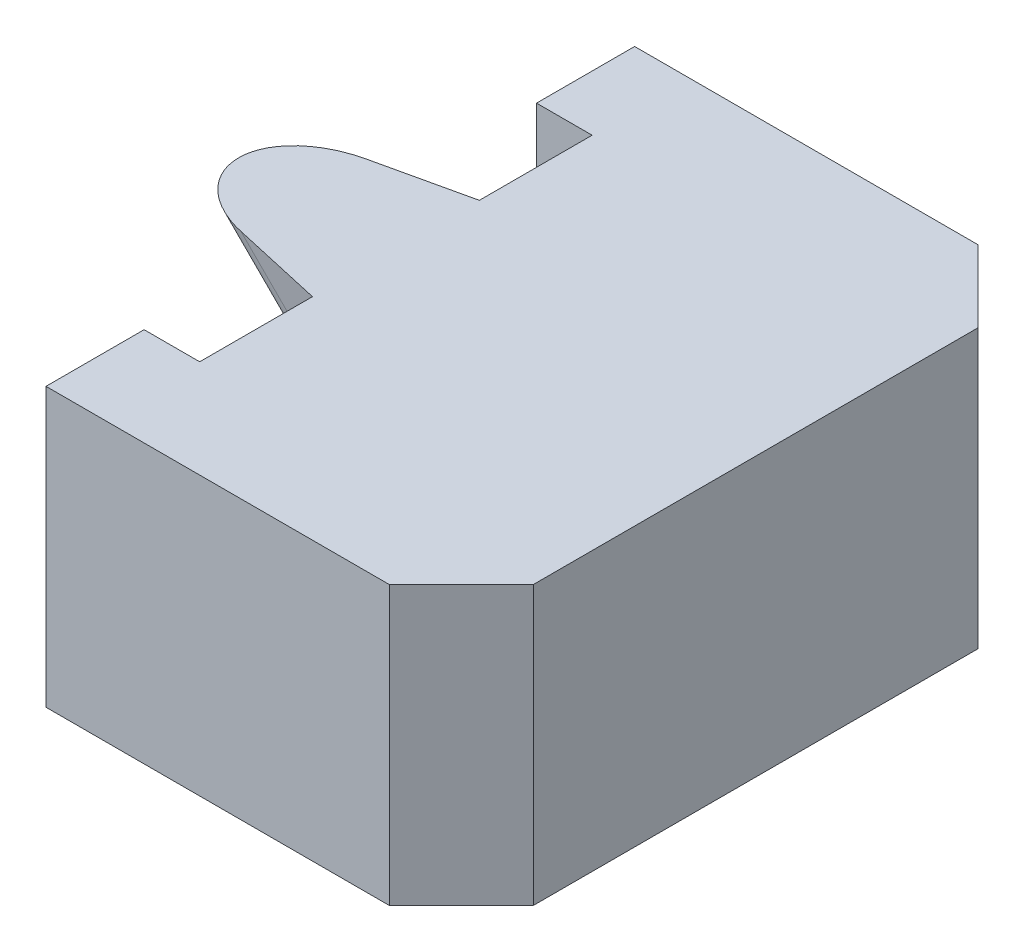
ISO-10303-21;
HEADER;
FILE_DESCRIPTION(('STEP AP214'),'2;1');
FILE_NAME('part.step','',(''),(''),'','','');
FILE_SCHEMA(('AUTOMOTIVE_DESIGN { 1 0 10303 214 1 1 1 1 }'));
ENDSEC;
DATA;
#1=APPLICATION_CONTEXT('core data for automotive mechanical design processes');
#2=APPLICATION_PROTOCOL_DEFINITION('international standard','automotive_design',2000,#1);
#3=PRODUCT_CONTEXT('',#1,'mechanical');
#4=PRODUCT('Part','Part','',(#3));
#5=PRODUCT_RELATED_PRODUCT_CATEGORY('part','',(#4));
#6=PRODUCT_DEFINITION_FORMATION('','',#4);
#7=PRODUCT_DEFINITION_CONTEXT('part definition',#1,'design');
#8=PRODUCT_DEFINITION('design','',#6,#7);
#9=PRODUCT_DEFINITION_SHAPE('','',#8);
#10=(LENGTH_UNIT() NAMED_UNIT(*) SI_UNIT(.MILLI.,.METRE.));
#11=(NAMED_UNIT(*) PLANE_ANGLE_UNIT() SI_UNIT($,.RADIAN.));
#12=(NAMED_UNIT(*) SI_UNIT($,.STERADIAN.) SOLID_ANGLE_UNIT());
#13=UNCERTAINTY_MEASURE_WITH_UNIT(LENGTH_MEASURE(1.E-05),#10,'distance_accuracy_value','');
#14=(GEOMETRIC_REPRESENTATION_CONTEXT(3) GLOBAL_UNCERTAINTY_ASSIGNED_CONTEXT((#13)) GLOBAL_UNIT_ASSIGNED_CONTEXT((#10,
#11,#12)) REPRESENTATION_CONTEXT('',''));
#15=CARTESIAN_POINT('',(0.,0.,0.));
#16=DIRECTION('',(0.,0.,1.));
#17=DIRECTION('',(1.,0.,0.));
#18=AXIS2_PLACEMENT_3D('',#15,#16,#17);
#19=CARTESIAN_POINT('',(-21.6603765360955,-8.5,10.766004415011));
#20=DIRECTION('',(1.,0.,0.));
#21=DIRECTION('',(0.,0.,-1.));
#22=AXIS2_PLACEMENT_3D('',#19,#20,#21);
#23=PLANE('',#22);
#24=DIRECTION('',(0.,0.975620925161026,0.219462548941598));
#25=VECTOR('',#24,1.);
#26=CARTESIAN_POINT('',(-21.6603765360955,-7.49665949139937,6.30565343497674));
#27=LINE('',#26,#25);
#28=CARTESIAN_POINT('',(-21.6603765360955,-5.82619744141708,6.68141808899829));
#29=VERTEX_POINT('',#28);
#30=CARTESIAN_POINT('',(-21.6603765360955,-3.,7.31716141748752));
#31=VERTEX_POINT('',#30);
#32=EDGE_CURVE('E44',#29,#31,#27,.T.);
#33=ORIENTED_EDGE('',*,*,#32,.F.);
#34=CARTESIAN_POINT('',(-21.6603765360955,-4.96446609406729,4.76600441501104));
#35=DIRECTION('',(1.,0.,0.));
#36=DIRECTION('',(0.,-1.,0.));
#37=AXIS2_PLACEMENT_3D('',#34,#35,#36);
#38=ELLIPSE('',#37,2.8425692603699,2.01);
#39=CARTESIAN_POINT('',(-21.6603765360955,-5.82619744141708,2.85059074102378));
#40=VERTEX_POINT('',#39);
#41=EDGE_CURVE('E11',#40,#29,#38,.F.);
#42=ORIENTED_EDGE('',*,*,#41,.F.);
#43=DIRECTION('',(0.,-0.975620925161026,0.219462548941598));
#44=VECTOR('',#43,1.);
#45=CARTESIAN_POINT('',(-21.6603765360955,-10.0660065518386,3.80432111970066));
#46=LINE('',#45,#44);
#47=CARTESIAN_POINT('',(-21.6603765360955,-3.,2.21484741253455));
#48=VERTEX_POINT('',#47);
#49=EDGE_CURVE('E144',#48,#40,#46,.T.);
#50=ORIENTED_EDGE('',*,*,#49,.F.);
#51=DIRECTION('',(0.,0.,-1.));
#52=VECTOR('',#51,1.);
#53=CARTESIAN_POINT('',(-21.6603765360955,-3.,-1.23399558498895));
#54=LINE('',#53,#52);
#55=CARTESIAN_POINT('',(-21.6603765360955,-3.,-1.23399558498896));
#56=VERTEX_POINT('',#55);
#57=EDGE_CURVE('E240',#48,#56,#54,.T.);
#58=ORIENTED_EDGE('',*,*,#57,.T.);
#59=DIRECTION('',(0.,1.,0.));
#60=VECTOR('',#59,1.);
#61=CARTESIAN_POINT('',(-21.6603765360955,-8.5,-1.23399558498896));
#62=LINE('',#61,#60);
#63=CARTESIAN_POINT('',(-21.6603765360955,-8.5,-1.23399558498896));
#64=VERTEX_POINT('',#63);
#65=EDGE_CURVE('E231',#64,#56,#62,.T.);
#66=ORIENTED_EDGE('',*,*,#65,.F.);
#67=DIRECTION('',(0.,0.,-1.));
#68=VECTOR('',#67,1.);
#69=CARTESIAN_POINT('',(-21.6603765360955,-8.5,10.766004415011));
#70=LINE('',#69,#68);
#71=CARTESIAN_POINT('',(-21.6603765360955,-8.5,10.766004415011));
#72=VERTEX_POINT('',#71);
#73=EDGE_CURVE('E194',#72,#64,#70,.T.);
#74=ORIENTED_EDGE('',*,*,#73,.F.);
#75=DIRECTION('',(0.,1.,0.));
#76=VECTOR('',#75,1.);
#77=CARTESIAN_POINT('',(-21.6603765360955,-8.5,10.766004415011));
#78=LINE('',#77,#76);
#79=CARTESIAN_POINT('',(-21.6603765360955,-3.,10.766004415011));
#80=VERTEX_POINT('',#79);
#81=EDGE_CURVE('E234',#72,#80,#78,.T.);
#82=ORIENTED_EDGE('',*,*,#81,.T.);
#83=EDGE_CURVE('E241',#80,#31,#54,.T.);
#84=ORIENTED_EDGE('',*,*,#83,.T.);
#85=EDGE_LOOP('',(#33,#42,#50,#58,#66,#74,#82,#84));
#86=FACE_BOUND('',#85,.T.);
#87=ADVANCED_FACE('F29',(#86),#23,.F.);
#88=CARTESIAN_POINT('',(-24.6603765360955,-3.,10.766004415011));
#89=DIRECTION('',(0.,0.,1.));
#90=DIRECTION('',(1.,0.,0.));
#91=AXIS2_PLACEMENT_3D('',#88,#89,#90);
#92=CYLINDRICAL_SURFACE('',#91,3.);
#93=CARTESIAN_POINT('',(-24.6603765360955,-3.,6.64232180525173));
#94=DIRECTION('',(0.214361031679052,0.214361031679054,-0.952942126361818));
#95=DIRECTION('',(0.673831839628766,0.673831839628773,0.303152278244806));
#96=AXIS2_PLACEMENT_3D('',#93,#94,#95);
#97=ELLIPSE('',#96,3.14814501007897,3.);
#98=CARTESIAN_POINT('',(-24.6603765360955,0.,7.31716141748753));
#99=VERTEX_POINT('',#98);
#100=EDGE_CURVE('E37',#31,#99,#97,.F.);
#101=ORIENTED_EDGE('',*,*,#100,.F.);
#102=ORIENTED_EDGE('',*,*,#83,.F.);
#103=CARTESIAN_POINT('',(-24.6603765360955,-3.,10.766004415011));
#104=DIRECTION('',(0.,0.,1.));
#105=DIRECTION('',(1.,0.,0.));
#106=AXIS2_PLACEMENT_3D('',#103,#104,#105);
#107=CIRCLE('',#106,3.);
#108=CARTESIAN_POINT('',(-24.6603765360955,0.,10.766004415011));
#109=VERTEX_POINT('',#108);
#110=EDGE_CURVE('E248',#109,#80,#107,.F.);
#111=ORIENTED_EDGE('',*,*,#110,.F.);
#112=DIRECTION('',(0.,0.,-1.));
#113=VECTOR('',#112,1.);
#114=CARTESIAN_POINT('',(-24.6603765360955,0.,10.766004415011));
#115=LINE('',#114,#113);
#116=EDGE_CURVE('E246',#99,#109,#115,.F.);
#117=ORIENTED_EDGE('',*,*,#116,.F.);
#118=EDGE_LOOP('',(#101,#102,#111,#117));
#119=FACE_BOUND('',#118,.T.);
#120=ADVANCED_FACE('F257',(#119),#92,.F.);
#121=CARTESIAN_POINT('',(-24.6603765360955,-3.,2.88968702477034));
#122=DIRECTION('',(0.214361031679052,0.214361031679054,0.952942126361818));
#123=DIRECTION('',(-0.673831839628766,-0.673831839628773,0.303152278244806));
#124=AXIS2_PLACEMENT_3D('',#121,#122,#123);
#125=ELLIPSE('',#124,3.14814501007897,3.);
#126=CARTESIAN_POINT('',(-24.6603765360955,0.,2.21484741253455));
#127=VERTEX_POINT('',#126);
#128=EDGE_CURVE('E250',#127,#48,#125,.F.);
#129=ORIENTED_EDGE('',*,*,#128,.F.);
#130=CARTESIAN_POINT('',(-24.6603765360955,0.,-1.23399558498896));
#131=VERTEX_POINT('',#130);
#132=EDGE_CURVE('E139',#131,#127,#115,.F.);
#133=ORIENTED_EDGE('',*,*,#132,.F.);
#134=CARTESIAN_POINT('',(-24.6603765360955,-3.,-1.23399558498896));
#135=DIRECTION('',(0.,0.,-1.));
#136=DIRECTION('',(-1.,0.,0.));
#137=AXIS2_PLACEMENT_3D('',#134,#135,#136);
#138=CIRCLE('',#137,3.);
#139=EDGE_CURVE('E243',#56,#131,#138,.F.);
#140=ORIENTED_EDGE('',*,*,#139,.F.);
#141=ORIENTED_EDGE('',*,*,#57,.F.);
#142=EDGE_LOOP('',(#129,#133,#140,#141));
#143=FACE_BOUND('',#142,.T.);
#144=ADVANCED_FACE('F299',(#143),#92,.F.);
#145=CARTESIAN_POINT('',(-26.3603765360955,-8.5,13.766004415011));
#146=DIRECTION('',(1.,0.,0.));
#147=DIRECTION('',(0.,0.,-1.));
#148=AXIS2_PLACEMENT_3D('',#145,#146,#147);
#149=PLANE('',#148);
#150=DIRECTION('',(0.,0.,-1.));
#151=VECTOR('',#150,1.);
#152=CARTESIAN_POINT('',(-26.3603765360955,0.,13.766004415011));
#153=LINE('',#152,#151);
#154=CARTESIAN_POINT('',(-26.3603765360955,0.,13.766004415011));
#155=VERTEX_POINT('',#154);
#156=CARTESIAN_POINT('',(-26.3603765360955,0.,10.766004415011));
#157=VERTEX_POINT('',#156);
#158=EDGE_CURVE('E153',#155,#157,#153,.T.);
#159=ORIENTED_EDGE('',*,*,#158,.T.);
#160=DIRECTION('',(0.,1.,0.));
#161=VECTOR('',#160,1.);
#162=CARTESIAN_POINT('',(-26.3603765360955,-8.5,10.766004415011));
#163=LINE('',#162,#161);
#164=CARTESIAN_POINT('',(-26.3603765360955,-8.5,10.766004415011));
#165=VERTEX_POINT('',#164);
#166=EDGE_CURVE('E237',#165,#157,#163,.T.);
#167=ORIENTED_EDGE('',*,*,#166,.F.);
#168=DIRECTION('',(0.,0.,-1.));
#169=VECTOR('',#168,1.);
#170=CARTESIAN_POINT('',(-26.3603765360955,-8.5,13.766004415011));
#171=LINE('',#170,#169);
#172=CARTESIAN_POINT('',(-26.3603765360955,-8.5,13.766004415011));
#173=VERTEX_POINT('',#172);
#174=EDGE_CURVE('E189',#173,#165,#171,.T.);
#175=ORIENTED_EDGE('',*,*,#174,.F.);
#176=DIRECTION('',(0.,1.,0.));
#177=VECTOR('',#176,1.);
#178=CARTESIAN_POINT('',(-26.3603765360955,-8.5,13.766004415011));
#179=LINE('',#178,#177);
#180=EDGE_CURVE('E210',#173,#155,#179,.T.);
#181=ORIENTED_EDGE('',*,*,#180,.T.);
#182=EDGE_LOOP('',(#159,#167,#175,#181));
#183=FACE_BOUND('',#182,.T.);
#184=ADVANCED_FACE('F31',(#183),#149,.F.);
#185=CARTESIAN_POINT('',(-26.3603765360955,-8.5,10.766004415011));
#186=DIRECTION('',(0.,0.,1.));
#187=DIRECTION('',(1.,0.,0.));
#188=AXIS2_PLACEMENT_3D('',#185,#186,#187);
#189=PLANE('',#188);
#190=DIRECTION('',(1.,0.,0.));
#191=VECTOR('',#190,1.);
#192=CARTESIAN_POINT('',(-26.3603765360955,0.,10.766004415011));
#193=LINE('',#192,#191);
#194=EDGE_CURVE('E165',#157,#109,#193,.T.);
#195=ORIENTED_EDGE('',*,*,#194,.T.);
#196=ORIENTED_EDGE('',*,*,#110,.T.);
#197=ORIENTED_EDGE('',*,*,#81,.F.);
#198=DIRECTION('',(1.,0.,0.));
#199=VECTOR('',#198,1.);
#200=CARTESIAN_POINT('',(-26.3603765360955,-8.5,10.766004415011));
#201=LINE('',#200,#199);
#202=EDGE_CURVE('E192',#165,#72,#201,.T.);
#203=ORIENTED_EDGE('',*,*,#202,.F.);
#204=ORIENTED_EDGE('',*,*,#166,.T.);
#205=EDGE_LOOP('',(#195,#196,#197,#203,#204));
#206=FACE_BOUND('',#205,.T.);
#207=ADVANCED_FACE('F263',(#206),#189,.F.);
#208=CARTESIAN_POINT('',(-21.6603765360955,-8.5,-1.23399558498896));
#209=DIRECTION('',(0.,0.,-1.));
#210=DIRECTION('',(-1.,0.,0.));
#211=AXIS2_PLACEMENT_3D('',#208,#209,#210);
#212=PLANE('',#211);
#213=ORIENTED_EDGE('',*,*,#65,.T.);
#214=ORIENTED_EDGE('',*,*,#139,.T.);
#215=DIRECTION('',(-1.,0.,0.));
#216=VECTOR('',#215,1.);
#217=CARTESIAN_POINT('',(-21.6603765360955,0.,-1.23399558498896));
#218=LINE('',#217,#216);
#219=CARTESIAN_POINT('',(-26.3603765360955,0.,-1.23399558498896));
#220=VERTEX_POINT('',#219);
#221=EDGE_CURVE('E168',#131,#220,#218,.T.);
#222=ORIENTED_EDGE('',*,*,#221,.T.);
#223=DIRECTION('',(0.,1.,0.));
#224=VECTOR('',#223,1.);
#225=CARTESIAN_POINT('',(-26.3603765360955,-8.5,-1.23399558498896));
#226=LINE('',#225,#224);
#227=CARTESIAN_POINT('',(-26.3603765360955,-8.5,-1.23399558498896));
#228=VERTEX_POINT('',#227);
#229=EDGE_CURVE('E228',#228,#220,#226,.T.);
#230=ORIENTED_EDGE('',*,*,#229,.F.);
#231=DIRECTION('',(-1.,0.,0.));
#232=VECTOR('',#231,1.);
#233=CARTESIAN_POINT('',(-21.6603765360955,-8.5,-1.23399558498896));
#234=LINE('',#233,#232);
#235=EDGE_CURVE('E196',#64,#228,#234,.T.);
#236=ORIENTED_EDGE('',*,*,#235,.F.);
#237=EDGE_LOOP('',(#213,#214,#222,#230,#236));
#238=FACE_BOUND('',#237,.T.);
#239=ADVANCED_FACE('F295',(#238),#212,.F.);
#240=CARTESIAN_POINT('',(-26.3603765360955,-8.5,-4.23399558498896));
#241=DIRECTION('',(1.,0.,0.));
#242=DIRECTION('',(0.,0.,-1.));
#243=AXIS2_PLACEMENT_3D('',#240,#241,#242);
#244=PLANE('',#243);
#245=DIRECTION('',(0.,0.,-1.));
#246=VECTOR('',#245,1.);
#247=CARTESIAN_POINT('',(-26.3603765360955,0.,-4.23399558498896));
#248=LINE('',#247,#246);
#249=CARTESIAN_POINT('',(-26.3603765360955,0.,-4.23399558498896));
#250=VERTEX_POINT('',#249);
#251=EDGE_CURVE('E171',#220,#250,#248,.T.);
#252=ORIENTED_EDGE('',*,*,#251,.T.);
#253=DIRECTION('',(0.,1.,0.));
#254=VECTOR('',#253,1.);
#255=CARTESIAN_POINT('',(-26.3603765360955,-8.5,-4.23399558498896));
#256=LINE('',#255,#254);
#257=CARTESIAN_POINT('',(-26.3603765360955,-8.5,-4.23399558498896));
#258=VERTEX_POINT('',#257);
#259=EDGE_CURVE('E225',#258,#250,#256,.T.);
#260=ORIENTED_EDGE('',*,*,#259,.F.);
#261=DIRECTION('',(0.,0.,-1.));
#262=VECTOR('',#261,1.);
#263=CARTESIAN_POINT('',(-26.3603765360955,-8.5,-4.23399558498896));
#264=LINE('',#263,#262);
#265=EDGE_CURVE('E198',#228,#258,#264,.T.);
#266=ORIENTED_EDGE('',*,*,#265,.F.);
#267=ORIENTED_EDGE('',*,*,#229,.T.);
#268=EDGE_LOOP('',(#252,#260,#266,#267));
#269=FACE_BOUND('',#268,.T.);
#270=ADVANCED_FACE('F292',(#269),#244,.F.);
#271=CARTESIAN_POINT('',(-26.3603765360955,-8.5,-4.23399558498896));
#272=DIRECTION('',(0.,0.,1.));
#273=DIRECTION('',(1.,0.,0.));
#274=AXIS2_PLACEMENT_3D('',#271,#272,#273);
#275=PLANE('',#274);
#276=DIRECTION('',(1.,0.,0.));
#277=VECTOR('',#276,1.);
#278=CARTESIAN_POINT('',(-26.3603765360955,0.,-4.23399558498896));
#279=LINE('',#278,#277);
#280=CARTESIAN_POINT('',(-15.8603765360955,0.,-4.23399558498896));
#281=VERTEX_POINT('',#280);
#282=EDGE_CURVE('E174',#250,#281,#279,.T.);
#283=ORIENTED_EDGE('',*,*,#282,.T.);
#284=DIRECTION('',(0.,1.,0.));
#285=VECTOR('',#284,1.);
#286=CARTESIAN_POINT('',(-15.8603765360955,-8.5,-4.23399558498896));
#287=LINE('',#286,#285);
#288=CARTESIAN_POINT('',(-15.8603765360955,-8.5,-4.23399558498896));
#289=VERTEX_POINT('',#288);
#290=EDGE_CURVE('E222',#289,#281,#287,.T.);
#291=ORIENTED_EDGE('',*,*,#290,.F.);
#292=DIRECTION('',(1.,0.,0.));
#293=VECTOR('',#292,1.);
#294=CARTESIAN_POINT('',(-26.3603765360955,-8.5,-4.23399558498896));
#295=LINE('',#294,#293);
#296=EDGE_CURVE('E200',#258,#289,#295,.T.);
#297=ORIENTED_EDGE('',*,*,#296,.F.);
#298=ORIENTED_EDGE('',*,*,#259,.T.);
#299=EDGE_LOOP('',(#283,#291,#297,#298));
#300=FACE_BOUND('',#299,.T.);
#301=ADVANCED_FACE('F287',(#300),#275,.F.);
#302=CARTESIAN_POINT('',(-13.6603765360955,-8.5,-2.03399558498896));
#303=DIRECTION('',(-0.707106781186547,0.,0.707106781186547));
#304=DIRECTION('',(0.707106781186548,0.,0.707106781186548));
#305=AXIS2_PLACEMENT_3D('',#302,#303,#304);
#306=PLANE('',#305);
#307=DIRECTION('',(0.707106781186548,0.,0.707106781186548));
#308=VECTOR('',#307,1.);
#309=CARTESIAN_POINT('',(-13.6603765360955,0.,-2.03399558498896));
#310=LINE('',#309,#308);
#311=CARTESIAN_POINT('',(-13.6603765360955,0.,-2.03399558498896));
#312=VERTEX_POINT('',#311);
#313=EDGE_CURVE('E177',#281,#312,#310,.T.);
#314=ORIENTED_EDGE('',*,*,#313,.T.);
#315=DIRECTION('',(0.,1.,0.));
#316=VECTOR('',#315,1.);
#317=CARTESIAN_POINT('',(-13.6603765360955,-8.5,-2.03399558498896));
#318=LINE('',#317,#316);
#319=CARTESIAN_POINT('',(-13.6603765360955,-8.5,-2.03399558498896));
#320=VERTEX_POINT('',#319);
#321=EDGE_CURVE('E219',#320,#312,#318,.T.);
#322=ORIENTED_EDGE('',*,*,#321,.F.);
#323=DIRECTION('',(0.707106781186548,0.,0.707106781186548));
#324=VECTOR('',#323,1.);
#325=CARTESIAN_POINT('',(-13.6603765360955,-8.5,-2.03399558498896));
#326=LINE('',#325,#324);
#327=EDGE_CURVE('E202',#289,#320,#326,.T.);
#328=ORIENTED_EDGE('',*,*,#327,.F.);
#329=ORIENTED_EDGE('',*,*,#290,.T.);
#330=EDGE_LOOP('',(#314,#322,#328,#329));
#331=FACE_BOUND('',#330,.T.);
#332=ADVANCED_FACE('F284',(#331),#306,.F.);
#333=CARTESIAN_POINT('',(-13.6603765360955,-8.5,11.566004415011));
#334=DIRECTION('',(-1.,0.,0.));
#335=DIRECTION('',(0.,0.,1.));
#336=AXIS2_PLACEMENT_3D('',#333,#334,#335);
#337=PLANE('',#336);
#338=DIRECTION('',(0.,0.,1.));
#339=VECTOR('',#338,1.);
#340=CARTESIAN_POINT('',(-13.6603765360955,0.,11.566004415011));
#341=LINE('',#340,#339);
#342=CARTESIAN_POINT('',(-13.6603765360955,0.,11.566004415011));
#343=VERTEX_POINT('',#342);
#344=EDGE_CURVE('E180',#312,#343,#341,.T.);
#345=ORIENTED_EDGE('',*,*,#344,.T.);
#346=DIRECTION('',(0.,1.,0.));
#347=VECTOR('',#346,1.);
#348=CARTESIAN_POINT('',(-13.6603765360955,-8.5,11.566004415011));
#349=LINE('',#348,#347);
#350=CARTESIAN_POINT('',(-13.6603765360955,-8.5,11.566004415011));
#351=VERTEX_POINT('',#350);
#352=EDGE_CURVE('E216',#351,#343,#349,.T.);
#353=ORIENTED_EDGE('',*,*,#352,.F.);
#354=DIRECTION('',(0.,0.,1.));
#355=VECTOR('',#354,1.);
#356=CARTESIAN_POINT('',(-13.6603765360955,-8.5,11.566004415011));
#357=LINE('',#356,#355);
#358=EDGE_CURVE('E204',#320,#351,#357,.T.);
#359=ORIENTED_EDGE('',*,*,#358,.F.);
#360=ORIENTED_EDGE('',*,*,#321,.T.);
#361=EDGE_LOOP('',(#345,#353,#359,#360));
#362=FACE_BOUND('',#361,.T.);
#363=ADVANCED_FACE('F280',(#362),#337,.F.);
#364=CARTESIAN_POINT('',(-15.8603765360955,-8.5,13.766004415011));
#365=DIRECTION('',(-0.707106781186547,0.,-0.707106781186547));
#366=DIRECTION('',(-0.707106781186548,0.,0.707106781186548));
#367=AXIS2_PLACEMENT_3D('',#364,#365,#366);
#368=PLANE('',#367);
#369=DIRECTION('',(-0.707106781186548,0.,0.707106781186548));
#370=VECTOR('',#369,1.);
#371=CARTESIAN_POINT('',(-15.8603765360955,0.,13.766004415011));
#372=LINE('',#371,#370);
#373=CARTESIAN_POINT('',(-15.8603765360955,0.,13.766004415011));
#374=VERTEX_POINT('',#373);
#375=EDGE_CURVE('E183',#343,#374,#372,.T.);
#376=ORIENTED_EDGE('',*,*,#375,.T.);
#377=DIRECTION('',(0.,1.,0.));
#378=VECTOR('',#377,1.);
#379=CARTESIAN_POINT('',(-15.8603765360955,-8.5,13.766004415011));
#380=LINE('',#379,#378);
#381=CARTESIAN_POINT('',(-15.8603765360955,-8.5,13.766004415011));
#382=VERTEX_POINT('',#381);
#383=EDGE_CURVE('E213',#382,#374,#380,.T.);
#384=ORIENTED_EDGE('',*,*,#383,.F.);
#385=DIRECTION('',(-0.707106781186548,0.,0.707106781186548));
#386=VECTOR('',#385,1.);
#387=CARTESIAN_POINT('',(-15.8603765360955,-8.5,13.766004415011));
#388=LINE('',#387,#386);
#389=EDGE_CURVE('E206',#351,#382,#388,.T.);
#390=ORIENTED_EDGE('',*,*,#389,.F.);
#391=ORIENTED_EDGE('',*,*,#352,.T.);
#392=EDGE_LOOP('',(#376,#384,#390,#391));
#393=FACE_BOUND('',#392,.T.);
#394=ADVANCED_FACE('F278',(#393),#368,.F.);
#395=CARTESIAN_POINT('',(-26.3603765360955,-8.5,13.766004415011));
#396=DIRECTION('',(0.,0.,-1.));
#397=DIRECTION('',(-1.,0.,0.));
#398=AXIS2_PLACEMENT_3D('',#395,#396,#397);
#399=PLANE('',#398);
#400=DIRECTION('',(-1.,0.,0.));
#401=VECTOR('',#400,1.);
#402=CARTESIAN_POINT('',(-26.3603765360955,0.,13.766004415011));
#403=LINE('',#402,#401);
#404=EDGE_CURVE('E186',#374,#155,#403,.T.);
#405=ORIENTED_EDGE('',*,*,#404,.T.);
#406=ORIENTED_EDGE('',*,*,#180,.F.);
#407=DIRECTION('',(-1.,0.,0.));
#408=VECTOR('',#407,1.);
#409=CARTESIAN_POINT('',(-26.3603765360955,-8.5,13.766004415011));
#410=LINE('',#409,#408);
#411=EDGE_CURVE('E208',#382,#173,#410,.T.);
#412=ORIENTED_EDGE('',*,*,#411,.F.);
#413=ORIENTED_EDGE('',*,*,#383,.T.);
#414=EDGE_LOOP('',(#405,#406,#412,#413));
#415=FACE_BOUND('',#414,.T.);
#416=ADVANCED_FACE('F268',(#415),#399,.F.);
#417=CARTESIAN_POINT('',(-26.3603765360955,-8.5,10.766004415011));
#418=DIRECTION('',(0.,-1.,0.));
#419=DIRECTION('',(0.,0.,-1.));
#420=AXIS2_PLACEMENT_3D('',#417,#418,#419);
#421=PLANE('',#420);
#422=ORIENTED_EDGE('',*,*,#174,.T.);
#423=ORIENTED_EDGE('',*,*,#202,.T.);
#424=ORIENTED_EDGE('',*,*,#73,.T.);
#425=ORIENTED_EDGE('',*,*,#235,.T.);
#426=ORIENTED_EDGE('',*,*,#265,.T.);
#427=ORIENTED_EDGE('',*,*,#296,.T.);
#428=ORIENTED_EDGE('',*,*,#327,.T.);
#429=ORIENTED_EDGE('',*,*,#358,.T.);
#430=ORIENTED_EDGE('',*,*,#389,.T.);
#431=ORIENTED_EDGE('',*,*,#411,.T.);
#432=EDGE_LOOP('',(#422,#423,#424,#425,#426,#427,#428,#429,#430,#431));
#433=FACE_BOUND('',#432,.T.);
#434=ADVANCED_FACE('F273',(#433),#421,.T.);
#435=CARTESIAN_POINT('',(-34.0347452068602,7.40990257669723,4.76600441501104));
#436=DIRECTION('',(0.707106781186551,-0.707106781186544,0.));
#437=DIRECTION('',(0.707106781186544,0.707106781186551,0.));
#438=AXIS2_PLACEMENT_3D('',#435,#436,#437);
#439=CYLINDRICAL_SURFACE('',#438,2.01);
#440=DIRECTION('',(0.707106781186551,-0.707106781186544,0.));
#441=VECTOR('',#440,1.);
#442=CARTESIAN_POINT('',(-34.4656108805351,6.97903690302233,6.68141808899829));
#443=LINE('',#442,#441);
#444=CARTESIAN_POINT('',(-27.4865739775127,0.,6.68141808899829));
#445=VERTEX_POINT('',#444);
#446=EDGE_CURVE('E152',#445,#29,#443,.T.);
#447=ORIENTED_EDGE('',*,*,#446,.F.);
#448=CARTESIAN_POINT('',(-26.6248426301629,0.,4.76600441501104));
#449=DIRECTION('',(0.,1.,0.));
#450=DIRECTION('',(1.,0.,0.));
#451=AXIS2_PLACEMENT_3D('',#448,#449,#450);
#452=ELLIPSE('',#451,2.84256926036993,2.01);
#453=CARTESIAN_POINT('',(-27.4865739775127,0.,2.85059074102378));
#454=VERTEX_POINT('',#453);
#455=EDGE_CURVE('E136',#445,#454,#452,.F.);
#456=ORIENTED_EDGE('',*,*,#455,.T.);
#457=DIRECTION('',(0.707106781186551,-0.707106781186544,0.));
#458=VECTOR('',#457,1.);
#459=CARTESIAN_POINT('',(-34.4656108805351,6.97903690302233,2.85059074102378));
#460=LINE('',#459,#458);
#461=EDGE_CURVE('E150',#454,#40,#460,.T.);
#462=ORIENTED_EDGE('',*,*,#461,.T.);
#463=ORIENTED_EDGE('',*,*,#41,.T.);
#464=EDGE_LOOP('',(#447,#456,#462,#463));
#465=FACE_BOUND('',#464,.T.);
#466=ADVANCED_FACE('F149',(#465),#439,.T.);
#467=CARTESIAN_POINT('',(-34.4656108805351,6.97903690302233,6.68141808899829));
#468=DIRECTION('',(0.214361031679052,0.214361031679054,-0.952942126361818));
#469=DIRECTION('',(0.,0.975620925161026,0.219462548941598));
#470=AXIS2_PLACEMENT_3D('',#467,#468,#469);
#471=PLANE('',#470);
#472=ORIENTED_EDGE('',*,*,#100,.T.);
#473=DIRECTION('',(-0.975620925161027,0.,-0.219462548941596));
#474=VECTOR('',#473,1.);
#475=CARTESIAN_POINT('',(-38.1404821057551,0.,4.28485834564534));
#476=LINE('',#475,#474);
#477=EDGE_CURVE('E154',#99,#445,#476,.T.);
#478=ORIENTED_EDGE('',*,*,#477,.T.);
#479=ORIENTED_EDGE('',*,*,#446,.T.);
#480=ORIENTED_EDGE('',*,*,#32,.T.);
#481=EDGE_LOOP('',(#472,#478,#479,#480));
#482=FACE_BOUND('',#481,.T.);
#483=ADVANCED_FACE('F253',(#482),#471,.F.);
#484=CARTESIAN_POINT('',(-34.4656108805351,6.97903690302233,2.85059074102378));
#485=DIRECTION('',(0.214361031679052,0.214361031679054,0.952942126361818));
#486=DIRECTION('',(0.,-0.975620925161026,0.219462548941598));
#487=AXIS2_PLACEMENT_3D('',#484,#485,#486);
#488=PLANE('',#487);
#489=ORIENTED_EDGE('',*,*,#461,.F.);
#490=DIRECTION('',(0.975620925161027,0.,-0.219462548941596));
#491=VECTOR('',#490,1.);
#492=CARTESIAN_POINT('',(-50.3860015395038,0.,8.00173767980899));
#493=LINE('',#492,#491);
#494=EDGE_CURVE('E133',#454,#127,#493,.T.);
#495=ORIENTED_EDGE('',*,*,#494,.T.);
#496=ORIENTED_EDGE('',*,*,#128,.T.);
#497=ORIENTED_EDGE('',*,*,#49,.T.);
#498=EDGE_LOOP('',(#489,#495,#496,#497));
#499=FACE_BOUND('',#498,.T.);
#500=ADVANCED_FACE('F156',(#499),#488,.F.);
#501=CARTESIAN_POINT('',(41.1067880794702,0.,120.056001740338));
#502=DIRECTION('',(0.,-1.,0.));
#503=DIRECTION('',(0.,0.,-1.));
#504=AXIS2_PLACEMENT_3D('',#501,#502,#503);
#505=PLANE('',#504);
#506=ORIENTED_EDGE('',*,*,#251,.F.);
#507=ORIENTED_EDGE('',*,*,#221,.F.);
#508=ORIENTED_EDGE('',*,*,#132,.T.);
#509=ORIENTED_EDGE('',*,*,#494,.F.);
#510=ORIENTED_EDGE('',*,*,#455,.F.);
#511=ORIENTED_EDGE('',*,*,#477,.F.);
#512=ORIENTED_EDGE('',*,*,#116,.T.);
#513=ORIENTED_EDGE('',*,*,#194,.F.);
#514=ORIENTED_EDGE('',*,*,#158,.F.);
#515=ORIENTED_EDGE('',*,*,#404,.F.);
#516=ORIENTED_EDGE('',*,*,#375,.F.);
#517=ORIENTED_EDGE('',*,*,#344,.F.);
#518=ORIENTED_EDGE('',*,*,#313,.F.);
#519=ORIENTED_EDGE('',*,*,#282,.F.);
#520=EDGE_LOOP('',(#506,#507,#508,#509,#510,#511,#512,#513,#514,#515,#516,#517,#518,#519));
#521=FACE_BOUND('',#520,.T.);
#522=ADVANCED_FACE('F135',(#521),#505,.F.);
#523=CLOSED_SHELL('',(#87,#120,#144,#184,#207,#239,#270,#301,#332,#363,#394,#416,#434,#466,#483,
#500,#522));
#524=MANIFOLD_SOLID_BREP('B2',#523);
#525=ADVANCED_BREP_SHAPE_REPRESENTATION('',(#18,#524),#14);
#526=SHAPE_DEFINITION_REPRESENTATION(#9,#525);
ENDSEC;
END-ISO-10303-21;
